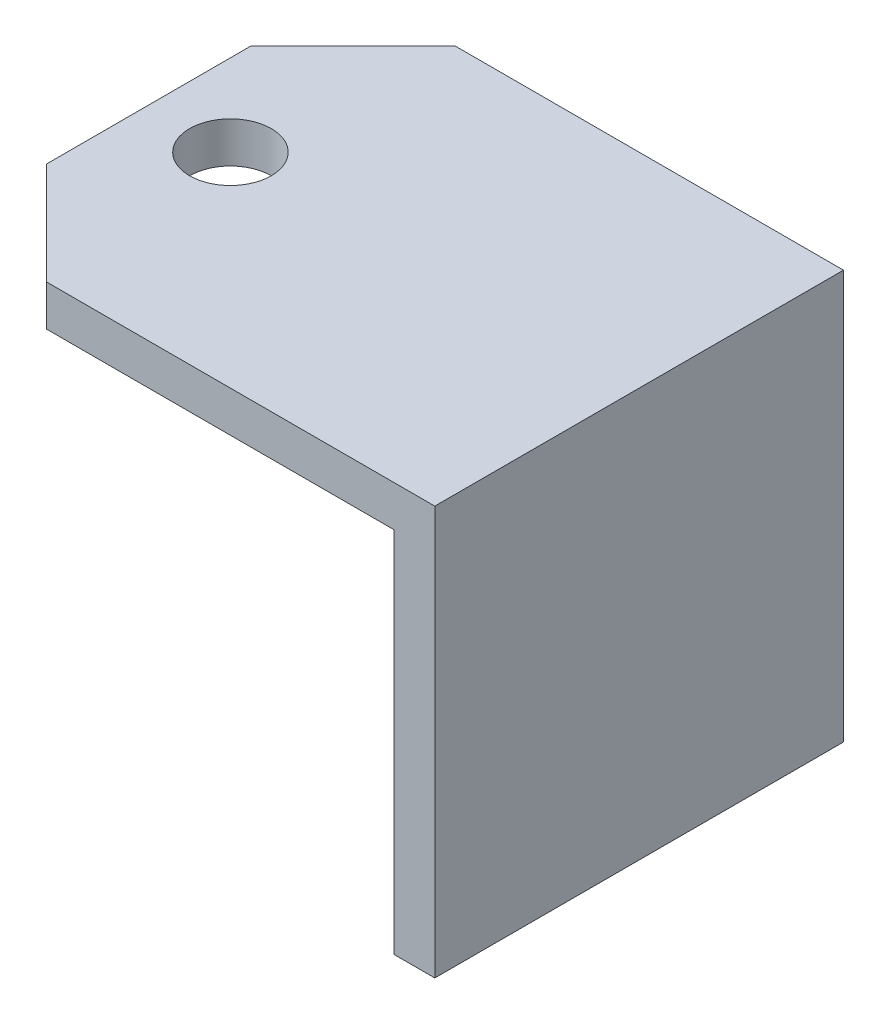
ISO-10303-21;
HEADER;
FILE_DESCRIPTION(('STEP AP214'),'2;1');
FILE_NAME('part.step','',(''),(''),'','','');
FILE_SCHEMA(('AUTOMOTIVE_DESIGN { 1 0 10303 214 1 1 1 1 }'));
ENDSEC;
DATA;
#1=APPLICATION_CONTEXT('core data for automotive mechanical design processes');
#2=APPLICATION_PROTOCOL_DEFINITION('international standard','automotive_design',2000,#1);
#3=PRODUCT_CONTEXT('',#1,'mechanical');
#4=PRODUCT('Part','Part','',(#3));
#5=PRODUCT_RELATED_PRODUCT_CATEGORY('part','',(#4));
#6=PRODUCT_DEFINITION_FORMATION('','',#4);
#7=PRODUCT_DEFINITION_CONTEXT('part definition',#1,'design');
#8=PRODUCT_DEFINITION('design','',#6,#7);
#9=PRODUCT_DEFINITION_SHAPE('','',#8);
#10=(LENGTH_UNIT() NAMED_UNIT(*) SI_UNIT(.MILLI.,.METRE.));
#11=(NAMED_UNIT(*) PLANE_ANGLE_UNIT() SI_UNIT($,.RADIAN.));
#12=(NAMED_UNIT(*) SI_UNIT($,.STERADIAN.) SOLID_ANGLE_UNIT());
#13=UNCERTAINTY_MEASURE_WITH_UNIT(LENGTH_MEASURE(1.E-05),#10,'distance_accuracy_value','');
#14=(GEOMETRIC_REPRESENTATION_CONTEXT(3) GLOBAL_UNCERTAINTY_ASSIGNED_CONTEXT((#13)) GLOBAL_UNIT_ASSIGNED_CONTEXT((#10,
#11,#12)) REPRESENTATION_CONTEXT('',''));
#15=CARTESIAN_POINT('',(0.,0.,0.));
#16=DIRECTION('',(0.,0.,1.));
#17=DIRECTION('',(1.,0.,0.));
#18=AXIS2_PLACEMENT_3D('',#15,#16,#17);
#19=CARTESIAN_POINT('',(0.,0.,0.));
#20=DIRECTION('',(1.,0.,0.));
#21=DIRECTION('',(0.,1.,0.));
#22=AXIS2_PLACEMENT_3D('',#19,#20,#21);
#23=PLANE('',#22);
#24=DIRECTION('',(0.,-1.,0.));
#25=VECTOR('',#24,1.);
#26=CARTESIAN_POINT('',(0.,0.,10.));
#27=LINE('',#26,#25);
#28=CARTESIAN_POINT('',(0.,0.,10.));
#29=VERTEX_POINT('',#28);
#30=CARTESIAN_POINT('',(0.,-20.,10.));
#31=VERTEX_POINT('',#30);
#32=EDGE_CURVE('E124',#29,#31,#27,.T.);
#33=ORIENTED_EDGE('',*,*,#32,.T.);
#34=DIRECTION('',(0.,0.,-1.));
#35=VECTOR('',#34,1.);
#36=CARTESIAN_POINT('',(0.,-20.,10.));
#37=LINE('',#36,#35);
#38=CARTESIAN_POINT('',(0.,-20.,-10.));
#39=VERTEX_POINT('',#38);
#40=EDGE_CURVE('E23',#31,#39,#37,.T.);
#41=ORIENTED_EDGE('',*,*,#40,.T.);
#42=DIRECTION('',(0.,1.,0.));
#43=VECTOR('',#42,1.);
#44=CARTESIAN_POINT('',(0.,-20.,-10.));
#45=LINE('',#44,#43);
#46=CARTESIAN_POINT('',(0.,0.,-10.));
#47=VERTEX_POINT('',#46);
#48=EDGE_CURVE('E121',#39,#47,#45,.T.);
#49=ORIENTED_EDGE('',*,*,#48,.T.);
#50=DIRECTION('',(0.,0.,1.));
#51=VECTOR('',#50,1.);
#52=CARTESIAN_POINT('',(0.,0.,-10.));
#53=LINE('',#52,#51);
#54=EDGE_CURVE('E9',#47,#29,#53,.T.);
#55=ORIENTED_EDGE('',*,*,#54,.T.);
#56=EDGE_LOOP('',(#33,#41,#49,#55));
#57=FACE_BOUND('',#56,.T.);
#58=ADVANCED_FACE('F15',(#57),#23,.T.);
#59=CARTESIAN_POINT('',(-24.,0.,0.));
#60=DIRECTION('',(0.,1.,0.));
#61=DIRECTION('',(1.,0.,0.));
#62=AXIS2_PLACEMENT_3D('',#59,#60,#61);
#63=PLANE('',#62);
#64=CARTESIAN_POINT('',(-20.,0.,0.));
#65=DIRECTION('',(0.,-1.,0.));
#66=DIRECTION('',(-1.,0.,0.));
#67=AXIS2_PLACEMENT_3D('',#64,#65,#66);
#68=CIRCLE('',#67,2.);
#69=CARTESIAN_POINT('',(-18.,0.,0.));
#70=VERTEX_POINT('',#69);
#71=EDGE_CURVE('E108',#70,#70,#68,.T.);
#72=ORIENTED_EDGE('',*,*,#71,.T.);
#73=EDGE_LOOP('',(#72));
#74=FACE_BOUND('',#73,.T.);
#75=DIRECTION('',(0.707106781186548,0.,-0.707106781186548));
#76=VECTOR('',#75,1.);
#77=CARTESIAN_POINT('',(-24.,0.,-5.));
#78=LINE('',#77,#76);
#79=CARTESIAN_POINT('',(-24.,0.,-5.));
#80=VERTEX_POINT('',#79);
#81=CARTESIAN_POINT('',(-19.,0.,-10.));
#82=VERTEX_POINT('',#81);
#83=EDGE_CURVE('E250',#80,#82,#78,.T.);
#84=ORIENTED_EDGE('',*,*,#83,.F.);
#85=DIRECTION('',(0.,0.,-1.));
#86=VECTOR('',#85,1.);
#87=CARTESIAN_POINT('',(-24.,0.,5.));
#88=LINE('',#87,#86);
#89=CARTESIAN_POINT('',(-24.,0.,5.));
#90=VERTEX_POINT('',#89);
#91=EDGE_CURVE('E224',#90,#80,#88,.T.);
#92=ORIENTED_EDGE('',*,*,#91,.F.);
#93=DIRECTION('',(-0.707106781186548,0.,-0.707106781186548));
#94=VECTOR('',#93,1.);
#95=CARTESIAN_POINT('',(-19.,0.,10.));
#96=LINE('',#95,#94);
#97=CARTESIAN_POINT('',(-19.,0.,10.));
#98=VERTEX_POINT('',#97);
#99=EDGE_CURVE('E188',#98,#90,#96,.T.);
#100=ORIENTED_EDGE('',*,*,#99,.F.);
#101=DIRECTION('',(1.,0.,0.));
#102=VECTOR('',#101,1.);
#103=CARTESIAN_POINT('',(-19.,0.,10.));
#104=LINE('',#103,#102);
#105=EDGE_CURVE('E114',#98,#29,#104,.T.);
#106=ORIENTED_EDGE('',*,*,#105,.T.);
#107=ORIENTED_EDGE('',*,*,#54,.F.);
#108=DIRECTION('',(-1.,0.,0.));
#109=VECTOR('',#108,1.);
#110=CARTESIAN_POINT('',(0.,0.,-10.));
#111=LINE('',#110,#109);
#112=EDGE_CURVE('E113',#47,#82,#111,.T.);
#113=ORIENTED_EDGE('',*,*,#112,.T.);
#114=EDGE_LOOP('',(#84,#92,#100,#106,#107,#113));
#115=FACE_BOUND('',#114,.T.);
#116=ADVANCED_FACE('F109',(#74,#115),#63,.T.);
#117=CARTESIAN_POINT('',(-2.,-20.,0.));
#118=DIRECTION('',(-1.,0.,0.));
#119=DIRECTION('',(0.,0.,1.));
#120=AXIS2_PLACEMENT_3D('',#117,#118,#119);
#121=PLANE('',#120);
#122=DIRECTION('',(0.,1.,0.));
#123=VECTOR('',#122,1.);
#124=CARTESIAN_POINT('',(-2.,-20.,10.));
#125=LINE('',#124,#123);
#126=CARTESIAN_POINT('',(-2.,-20.,10.));
#127=VERTEX_POINT('',#126);
#128=CARTESIAN_POINT('',(-2.,-2.,10.));
#129=VERTEX_POINT('',#128);
#130=EDGE_CURVE('E175',#127,#129,#125,.T.);
#131=ORIENTED_EDGE('',*,*,#130,.T.);
#132=DIRECTION('',(0.,0.,-1.));
#133=VECTOR('',#132,1.);
#134=CARTESIAN_POINT('',(-2.,-2.,10.));
#135=LINE('',#134,#133);
#136=CARTESIAN_POINT('',(-2.,-2.,-10.));
#137=VERTEX_POINT('',#136);
#138=EDGE_CURVE('E204',#129,#137,#135,.T.);
#139=ORIENTED_EDGE('',*,*,#138,.T.);
#140=DIRECTION('',(0.,-1.,0.));
#141=VECTOR('',#140,1.);
#142=CARTESIAN_POINT('',(-2.,-2.,-10.));
#143=LINE('',#142,#141);
#144=CARTESIAN_POINT('',(-2.,-20.,-10.));
#145=VERTEX_POINT('',#144);
#146=EDGE_CURVE('E133',#137,#145,#143,.T.);
#147=ORIENTED_EDGE('',*,*,#146,.T.);
#148=DIRECTION('',(0.,0.,-1.));
#149=VECTOR('',#148,1.);
#150=CARTESIAN_POINT('',(-2.,-20.,10.));
#151=LINE('',#150,#149);
#152=EDGE_CURVE('E35',#127,#145,#151,.T.);
#153=ORIENTED_EDGE('',*,*,#152,.F.);
#154=EDGE_LOOP('',(#131,#139,#147,#153));
#155=FACE_BOUND('',#154,.T.);
#156=ADVANCED_FACE('F297',(#155),#121,.T.);
#157=CARTESIAN_POINT('',(0.,-20.,0.));
#158=DIRECTION('',(0.,-1.,0.));
#159=DIRECTION('',(0.,0.,-1.));
#160=AXIS2_PLACEMENT_3D('',#157,#158,#159);
#161=PLANE('',#160);
#162=DIRECTION('',(-1.,0.,0.));
#163=VECTOR('',#162,1.);
#164=CARTESIAN_POINT('',(0.,-20.,10.));
#165=LINE('',#164,#163);
#166=EDGE_CURVE('E170',#31,#127,#165,.T.);
#167=ORIENTED_EDGE('',*,*,#166,.T.);
#168=ORIENTED_EDGE('',*,*,#152,.T.);
#169=DIRECTION('',(1.,0.,0.));
#170=VECTOR('',#169,1.);
#171=CARTESIAN_POINT('',(-2.,-20.,-10.));
#172=LINE('',#171,#170);
#173=EDGE_CURVE('E130',#145,#39,#172,.T.);
#174=ORIENTED_EDGE('',*,*,#173,.T.);
#175=ORIENTED_EDGE('',*,*,#40,.F.);
#176=EDGE_LOOP('',(#167,#168,#174,#175));
#177=FACE_BOUND('',#176,.T.);
#178=ADVANCED_FACE('F314',(#177),#161,.T.);
#179=CARTESIAN_POINT('',(-7.5,-5.5,-10.));
#180=DIRECTION('',(0.,0.,1.));
#181=DIRECTION('',(1.,0.,0.));
#182=AXIS2_PLACEMENT_3D('',#179,#180,#181);
#183=PLANE('',#182);
#184=DIRECTION('',(0.,-1.,0.));
#185=VECTOR('',#184,1.);
#186=CARTESIAN_POINT('',(-19.,0.,-10.));
#187=LINE('',#186,#185);
#188=CARTESIAN_POINT('',(-19.,-2.,-10.));
#189=VERTEX_POINT('',#188);
#190=EDGE_CURVE('E245',#82,#189,#187,.T.);
#191=ORIENTED_EDGE('',*,*,#190,.F.);
#192=ORIENTED_EDGE('',*,*,#112,.F.);
#193=ORIENTED_EDGE('',*,*,#48,.F.);
#194=ORIENTED_EDGE('',*,*,#173,.F.);
#195=ORIENTED_EDGE('',*,*,#146,.F.);
#196=DIRECTION('',(1.,0.,0.));
#197=VECTOR('',#196,1.);
#198=CARTESIAN_POINT('',(-19.,-2.,-10.));
#199=LINE('',#198,#197);
#200=EDGE_CURVE('E217',#189,#137,#199,.T.);
#201=ORIENTED_EDGE('',*,*,#200,.F.);
#202=EDGE_LOOP('',(#191,#192,#193,#194,#195,#201));
#203=FACE_BOUND('',#202,.T.);
#204=ADVANCED_FACE('F294',(#203),#183,.F.);
#205=CARTESIAN_POINT('',(-20.,0.,0.));
#206=DIRECTION('',(0.,-1.,0.));
#207=DIRECTION('',(-1.,0.,0.));
#208=AXIS2_PLACEMENT_3D('',#205,#206,#207);
#209=CYLINDRICAL_SURFACE('',#208,2.);
#210=ORIENTED_EDGE('',*,*,#71,.F.);
#211=EDGE_LOOP('',(#210));
#212=FACE_BOUND('',#211,.T.);
#213=CARTESIAN_POINT('',(-20.,-2.,0.));
#214=DIRECTION('',(0.,1.,0.));
#215=DIRECTION('',(-1.,0.,0.));
#216=AXIS2_PLACEMENT_3D('',#213,#214,#215);
#217=CIRCLE('',#216,2.);
#218=CARTESIAN_POINT('',(-18.,-2.,0.));
#219=VERTEX_POINT('',#218);
#220=EDGE_CURVE('E194',#219,#219,#217,.T.);
#221=ORIENTED_EDGE('',*,*,#220,.F.);
#222=EDGE_LOOP('',(#221));
#223=FACE_BOUND('',#222,.T.);
#224=ADVANCED_FACE('F321',(#212,#223),#209,.F.);
#225=CARTESIAN_POINT('',(-7.5,-5.5,10.));
#226=DIRECTION('',(0.,0.,1.));
#227=DIRECTION('',(1.,0.,0.));
#228=AXIS2_PLACEMENT_3D('',#225,#226,#227);
#229=PLANE('',#228);
#230=DIRECTION('',(0.,1.,0.));
#231=VECTOR('',#230,1.);
#232=CARTESIAN_POINT('',(-19.,-2.,10.));
#233=LINE('',#232,#231);
#234=CARTESIAN_POINT('',(-19.,-2.,10.));
#235=VERTEX_POINT('',#234);
#236=EDGE_CURVE('E181',#235,#98,#233,.T.);
#237=ORIENTED_EDGE('',*,*,#236,.F.);
#238=DIRECTION('',(-1.,0.,0.));
#239=VECTOR('',#238,1.);
#240=CARTESIAN_POINT('',(-2.,-2.,10.));
#241=LINE('',#240,#239);
#242=EDGE_CURVE('E198',#129,#235,#241,.T.);
#243=ORIENTED_EDGE('',*,*,#242,.F.);
#244=ORIENTED_EDGE('',*,*,#130,.F.);
#245=ORIENTED_EDGE('',*,*,#166,.F.);
#246=ORIENTED_EDGE('',*,*,#32,.F.);
#247=ORIENTED_EDGE('',*,*,#105,.F.);
#248=EDGE_LOOP('',(#237,#243,#244,#245,#246,#247));
#249=FACE_BOUND('',#248,.T.);
#250=ADVANCED_FACE('F301',(#249),#229,.T.);
#251=CARTESIAN_POINT('',(-21.5,-3.75,7.5));
#252=DIRECTION('',(-0.707106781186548,0.,0.707106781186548));
#253=DIRECTION('',(0.,1.,0.));
#254=AXIS2_PLACEMENT_3D('',#251,#252,#253);
#255=PLANE('',#254);
#256=ORIENTED_EDGE('',*,*,#99,.T.);
#257=DIRECTION('',(0.,-1.,0.));
#258=VECTOR('',#257,1.);
#259=CARTESIAN_POINT('',(-24.,0.,5.));
#260=LINE('',#259,#258);
#261=CARTESIAN_POINT('',(-24.,-2.,5.));
#262=VERTEX_POINT('',#261);
#263=EDGE_CURVE('E230',#90,#262,#260,.T.);
#264=ORIENTED_EDGE('',*,*,#263,.T.);
#265=DIRECTION('',(0.707106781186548,0.,0.707106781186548));
#266=VECTOR('',#265,1.);
#267=CARTESIAN_POINT('',(-24.,-2.,5.));
#268=LINE('',#267,#266);
#269=EDGE_CURVE('E203',#262,#235,#268,.T.);
#270=ORIENTED_EDGE('',*,*,#269,.T.);
#271=ORIENTED_EDGE('',*,*,#236,.T.);
#272=EDGE_LOOP('',(#256,#264,#270,#271));
#273=FACE_BOUND('',#272,.T.);
#274=ADVANCED_FACE('F305',(#273),#255,.T.);
#275=CARTESIAN_POINT('',(-2.,-2.,0.));
#276=DIRECTION('',(0.,-1.,0.));
#277=DIRECTION('',(0.,0.,-1.));
#278=AXIS2_PLACEMENT_3D('',#275,#276,#277);
#279=PLANE('',#278);
#280=ORIENTED_EDGE('',*,*,#220,.T.);
#281=EDGE_LOOP('',(#280));
#282=FACE_BOUND('',#281,.T.);
#283=DIRECTION('',(-0.707106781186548,0.,0.707106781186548));
#284=VECTOR('',#283,1.);
#285=CARTESIAN_POINT('',(-19.,-2.,-10.));
#286=LINE('',#285,#284);
#287=CARTESIAN_POINT('',(-24.,-2.,-5.));
#288=VERTEX_POINT('',#287);
#289=EDGE_CURVE('E268',#189,#288,#286,.T.);
#290=ORIENTED_EDGE('',*,*,#289,.F.);
#291=ORIENTED_EDGE('',*,*,#200,.T.);
#292=ORIENTED_EDGE('',*,*,#138,.F.);
#293=ORIENTED_EDGE('',*,*,#242,.T.);
#294=ORIENTED_EDGE('',*,*,#269,.F.);
#295=DIRECTION('',(0.,0.,-1.));
#296=VECTOR('',#295,1.);
#297=CARTESIAN_POINT('',(-24.,-2.,5.));
#298=LINE('',#297,#296);
#299=EDGE_CURVE('E237',#262,#288,#298,.T.);
#300=ORIENTED_EDGE('',*,*,#299,.T.);
#301=EDGE_LOOP('',(#290,#291,#292,#293,#294,#300));
#302=FACE_BOUND('',#301,.T.);
#303=ADVANCED_FACE('F282',(#282,#302),#279,.T.);
#304=CARTESIAN_POINT('',(-24.,-2.,0.));
#305=DIRECTION('',(-1.,0.,0.));
#306=DIRECTION('',(0.,0.,1.));
#307=AXIS2_PLACEMENT_3D('',#304,#305,#306);
#308=PLANE('',#307);
#309=DIRECTION('',(0.,1.,0.));
#310=VECTOR('',#309,1.);
#311=CARTESIAN_POINT('',(-24.,-2.,-5.));
#312=LINE('',#311,#310);
#313=EDGE_CURVE('E257',#288,#80,#312,.T.);
#314=ORIENTED_EDGE('',*,*,#313,.F.);
#315=ORIENTED_EDGE('',*,*,#299,.F.);
#316=ORIENTED_EDGE('',*,*,#263,.F.);
#317=ORIENTED_EDGE('',*,*,#91,.T.);
#318=EDGE_LOOP('',(#314,#315,#316,#317));
#319=FACE_BOUND('',#318,.T.);
#320=ADVANCED_FACE('F287',(#319),#308,.T.);
#321=CARTESIAN_POINT('',(-21.5,-3.75,-7.5));
#322=DIRECTION('',(-0.707106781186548,0.,-0.707106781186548));
#323=DIRECTION('',(-0.707106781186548,0.,0.707106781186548));
#324=AXIS2_PLACEMENT_3D('',#321,#322,#323);
#325=PLANE('',#324);
#326=ORIENTED_EDGE('',*,*,#289,.T.);
#327=ORIENTED_EDGE('',*,*,#313,.T.);
#328=ORIENTED_EDGE('',*,*,#83,.T.);
#329=ORIENTED_EDGE('',*,*,#190,.T.);
#330=EDGE_LOOP('',(#326,#327,#328,#329));
#331=FACE_BOUND('',#330,.T.);
#332=ADVANCED_FACE('F278',(#331),#325,.T.);
#333=CLOSED_SHELL('',(#58,#116,#156,#178,#204,#224,#250,#274,#303,#320,#332));
#334=MANIFOLD_SOLID_BREP('B1',#333);
#335=ADVANCED_BREP_SHAPE_REPRESENTATION('',(#18,#334),#14);
#336=SHAPE_DEFINITION_REPRESENTATION(#9,#335);
ENDSEC;
END-ISO-10303-21;
